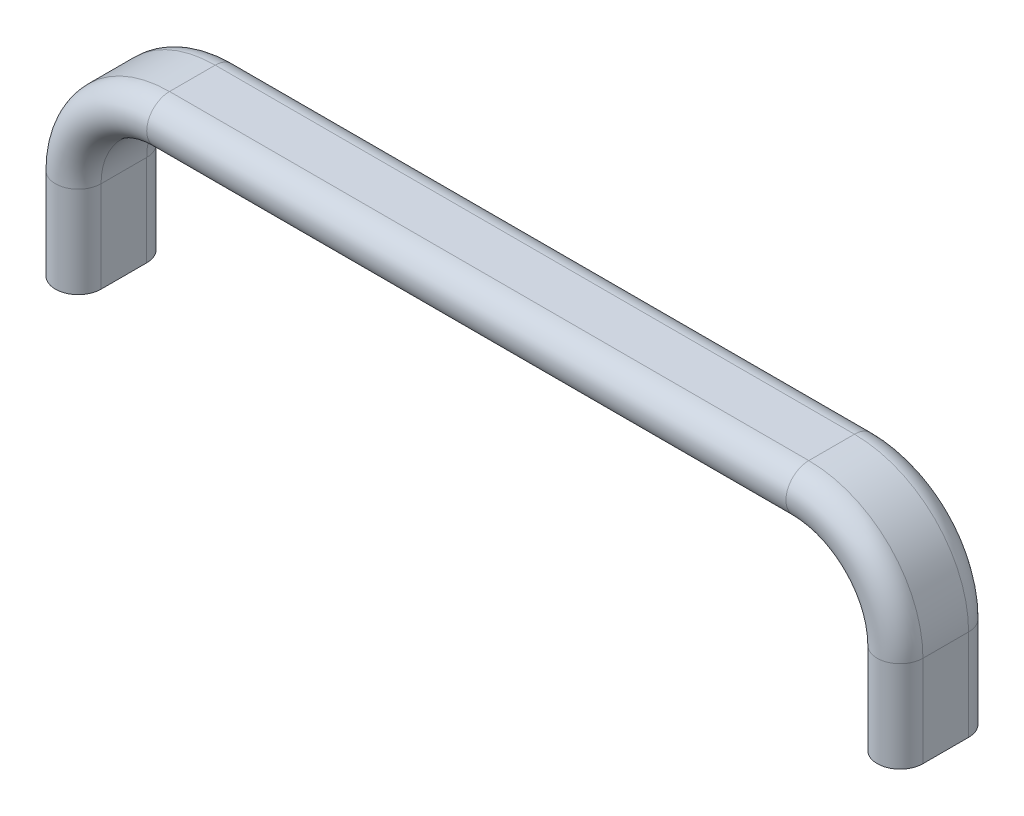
from build123d import *

# Parameters (mm, degrees)
SKETCH3_R      = 2.1
EXTRUDE1_DEPTH = 12.5
SKETCH4_R      = 2.5
EXTRUDE2_DEPTH = 10


with BuildPart() as part:
    # Sweep1: sweep along a path in Sketch1
    with BuildLine(Plane.XY) as sweep1_path:
        Line((-90, 0), (-90, 20))
        ThreePointArc((-90, 20), (-84.142135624, 34.142135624), (-70, 40))
        Line((-70, 40), (70, 40))
        ThreePointArc((70, 40), (84.142135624, 34.142135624), (90, 20))
        Line((90, 20), (90, 0))
    # Sketch2 → Sweep1 (sweep)
    with BuildSketch(Plane(origin=(0, 0, 0), x_dir=(1, 0, 0), z_dir=(0, 1, 0))):
        with BuildLine():
            Line((-95, -5), (-95, 5))
            ThreePointArc((-95, 5), (-90, 10), (-85, 5))
            Line((-85, 5), (-85, -5))
            ThreePointArc((-85, -5), (-90, -10), (-95, -5))
        make_face()
    sweep(path=sweep1_path.line)

    # Sketch3 → Extrude1 (cut)
    with BuildSketch(Plane.XZ):
        with Locations(Location((-90, 0, 0), (0, 0, 270))):
            Circle(SKETCH3_R)
    extrude1 = extrude(amount=-EXTRUDE1_DEPTH, mode=Mode.SUBTRACT)

    # Sketch4 → Extrude2 (cut)
    with BuildSketch(Plane.XZ):
        with Locations(Location((-90, 0, 0), (0, 0, 270))):
            Circle(SKETCH4_R)
    extrude2 = extrude(amount=-EXTRUDE2_DEPTH, mode=Mode.SUBTRACT)

    # Sketch5 → Cut-Revolve1 (revolve, cut)
    with BuildSketch(Plane.XY, mode=Mode.PRIVATE) as cut_revolve1_sk:
        Polygon((-90, 12.5), (-92.1, 12.5), (-90, 13.712435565), align=None)
    cut_revolve1 = revolve(cut_revolve1_sk.sketch.rotate(Axis((-90, 13.712435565, 0), (0, -1, 0)), 90), axis=Axis((-90, 13.712435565, 0), (0, -1, 0)), mode=Mode.SUBTRACT)

    # Mirror1: Extrude1, Extrude2, Cut-Revolve1 across plane
    add(extrude1.mirror(Plane(origin=(0, 0, 0), x_dir=(0, 0, 1), z_dir=(1, 0, 0))), mode=Mode.SUBTRACT)
    add(extrude2.mirror(Plane(origin=(0, 0, 0), x_dir=(0, 0, 1), z_dir=(1, 0, 0))), mode=Mode.SUBTRACT)
    add(cut_revolve1.mirror(Plane(origin=(0, 0, 0), x_dir=(0, 0, 1), z_dir=(1, 0, 0))), mode=Mode.SUBTRACT)


solid = part.part
